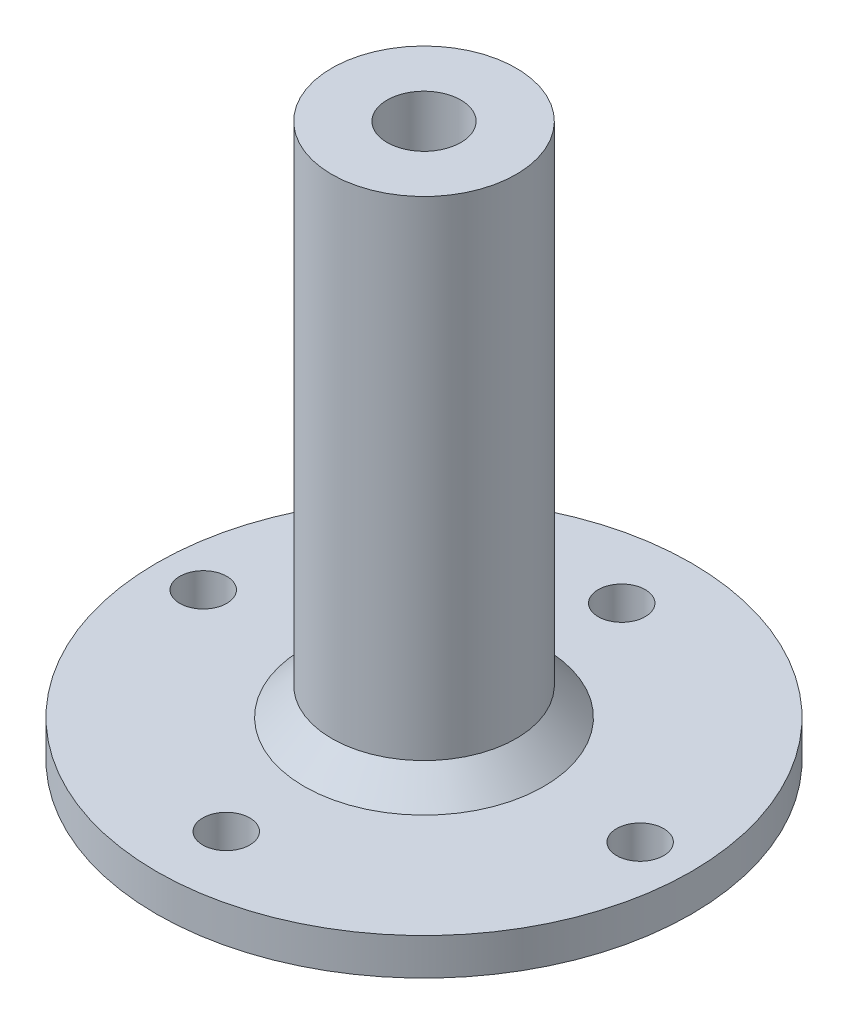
from build123d import *

# Parameters (mm, degrees)
SKETCH1_R           = 29
SKETCH1_R_2         = 2.55
BOSS_EXTRUDE1_DEPTH = 4
SKETCH2_R           = 10
BOSS_EXTRUDE2_DEPTH = 56
CHAMFER1_SIZE       = 3
SKETCH3_R           = 4
CUT_EXTRUDE1_DEPTH  = 73.677369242


with BuildPart() as part:
    # Sketch1 → Boss-Extrude1 (new body)
    with BuildSketch(Plane(origin=(0, 0, 0), x_dir=(1, 0, 0), z_dir=(0, 1, 0))):
        with Locations(Location((0, 0, 0), (0, 0, 270))):
            Circle(SKETCH1_R)
        with Locations(Location((-23.95, 0, 0), (0, 0, 270))):
            Circle(SKETCH1_R_2, mode=Mode.SUBTRACT)
        with Locations(Location((23.45, 0, 0), (0, 0, 270))):
            Circle(SKETCH1_R_2, mode=Mode.SUBTRACT)
        with Locations(Location((0, 21.45, 0), (0, 0, 270))):
            Circle(SKETCH1_R_2, mode=Mode.SUBTRACT)
        with Locations(Location((0, -21.45, 0), (0, 0, 270))):
            Circle(SKETCH1_R_2, mode=Mode.SUBTRACT)
    extrude(amount=BOSS_EXTRUDE1_DEPTH)

    # Sketch2 → Boss-Extrude2 (add)
    with BuildSketch(Plane(origin=(0, 4, 0), x_dir=(1, 0, 0), z_dir=(0, 1, 0))):
        with Locations(Location((0, 0, 0), (0, 0, 270))):
            Circle(SKETCH2_R)
    extrude(amount=BOSS_EXTRUDE2_DEPTH)

    # Chamfer1
    chamfer1_edges = [part.edges().sort_by_distance(p)[0] for p in [
        (0, 4, -10),
    ]]
    chamfer(chamfer1_edges, length=CHAMFER1_SIZE)

    # Sketch3 → Cut-Extrude1 (cut, through all)
    with BuildSketch(Plane(origin=(0, 60, 0), x_dir=(1, 0, 0), z_dir=(0, 1, 0))):
        with Locations(Location((0, 0, 0), (0, 0, 270))):
            Circle(SKETCH3_R)
    extrude(amount=-CUT_EXTRUDE1_DEPTH, mode=Mode.SUBTRACT)


solid = part.part
